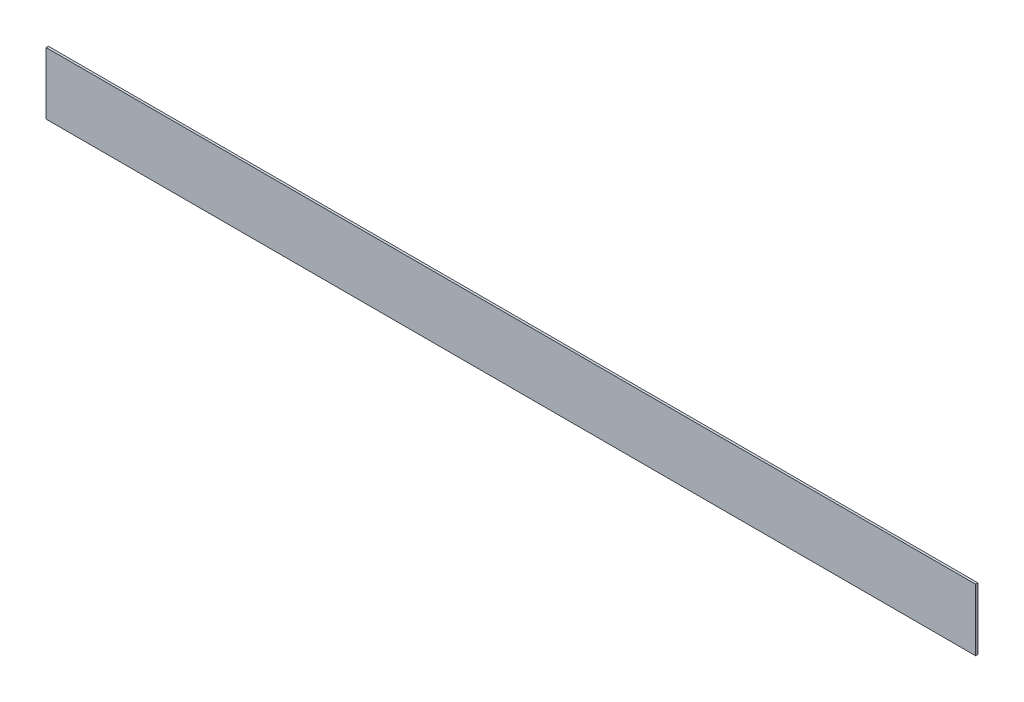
ISO-10303-21;
HEADER;
FILE_DESCRIPTION(('STEP AP214'),'2;1');
FILE_NAME('part.step','',(''),(''),'','','');
FILE_SCHEMA(('AUTOMOTIVE_DESIGN { 1 0 10303 214 1 1 1 1 }'));
ENDSEC;
DATA;
#1=APPLICATION_CONTEXT('core data for automotive mechanical design processes');
#2=APPLICATION_PROTOCOL_DEFINITION('international standard','automotive_design',2000,#1);
#3=PRODUCT_CONTEXT('',#1,'mechanical');
#4=PRODUCT('Part','Part','',(#3));
#5=PRODUCT_RELATED_PRODUCT_CATEGORY('part','',(#4));
#6=PRODUCT_DEFINITION_FORMATION('','',#4);
#7=PRODUCT_DEFINITION_CONTEXT('part definition',#1,'design');
#8=PRODUCT_DEFINITION('design','',#6,#7);
#9=PRODUCT_DEFINITION_SHAPE('','',#8);
#10=(LENGTH_UNIT() NAMED_UNIT(*) SI_UNIT(.MILLI.,.METRE.));
#11=(NAMED_UNIT(*) PLANE_ANGLE_UNIT() SI_UNIT($,.RADIAN.));
#12=(NAMED_UNIT(*) SI_UNIT($,.STERADIAN.) SOLID_ANGLE_UNIT());
#13=UNCERTAINTY_MEASURE_WITH_UNIT(LENGTH_MEASURE(1.E-05),#10,'distance_accuracy_value','');
#14=(GEOMETRIC_REPRESENTATION_CONTEXT(3) GLOBAL_UNCERTAINTY_ASSIGNED_CONTEXT((#13)) GLOBAL_UNIT_ASSIGNED_CONTEXT((#10,
#11,#12)) REPRESENTATION_CONTEXT('',''));
#15=CARTESIAN_POINT('',(0.,0.,0.));
#16=DIRECTION('',(0.,0.,1.));
#17=DIRECTION('',(1.,0.,0.));
#18=AXIS2_PLACEMENT_3D('',#15,#16,#17);
#19=CARTESIAN_POINT('',(0.,-203.2,0.));
#20=DIRECTION('',(-1.,0.,0.));
#21=DIRECTION('',(0.,0.,1.));
#22=AXIS2_PLACEMENT_3D('',#19,#20,#21);
#23=PLANE('',#22);
#24=DIRECTION('',(0.,0.,1.));
#25=VECTOR('',#24,1.);
#26=CARTESIAN_POINT('',(0.,0.,0.));
#27=LINE('',#26,#25);
#28=CARTESIAN_POINT('',(0.,0.,-7.62000000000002));
#29=VERTEX_POINT('',#28);
#30=CARTESIAN_POINT('',(0.,0.,0.));
#31=VERTEX_POINT('',#30);
#32=EDGE_CURVE('E115',#29,#31,#27,.T.);
#33=ORIENTED_EDGE('',*,*,#32,.F.);
#34=DIRECTION('',(0.,1.,0.));
#35=VECTOR('',#34,1.);
#36=CARTESIAN_POINT('',(0.,-203.2,-7.62000000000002));
#37=LINE('',#36,#35);
#38=CARTESIAN_POINT('',(0.,-203.2,-7.62000000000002));
#39=VERTEX_POINT('',#38);
#40=EDGE_CURVE('E11',#39,#29,#37,.T.);
#41=ORIENTED_EDGE('',*,*,#40,.F.);
#42=DIRECTION('',(0.,0.,1.));
#43=VECTOR('',#42,1.);
#44=CARTESIAN_POINT('',(0.,-203.2,0.));
#45=LINE('',#44,#43);
#46=CARTESIAN_POINT('',(0.,-203.2,0.));
#47=VERTEX_POINT('',#46);
#48=EDGE_CURVE('E107',#39,#47,#45,.T.);
#49=ORIENTED_EDGE('',*,*,#48,.T.);
#50=DIRECTION('',(0.,1.,0.));
#51=VECTOR('',#50,1.);
#52=CARTESIAN_POINT('',(0.,-203.2,0.));
#53=LINE('',#52,#51);
#54=EDGE_CURVE('E48',#47,#31,#53,.T.);
#55=ORIENTED_EDGE('',*,*,#54,.T.);
#56=EDGE_LOOP('',(#33,#41,#49,#55));
#57=FACE_BOUND('',#56,.T.);
#58=ADVANCED_FACE('F45',(#57),#23,.T.);
#59=CARTESIAN_POINT('',(0.,-203.2,-7.62000000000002));
#60=DIRECTION('',(0.,0.,-1.));
#61=DIRECTION('',(-1.,0.,0.));
#62=AXIS2_PLACEMENT_3D('',#59,#60,#61);
#63=PLANE('',#62);
#64=DIRECTION('',(-1.,0.,0.));
#65=VECTOR('',#64,1.);
#66=CARTESIAN_POINT('',(0.,0.,-7.62000000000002));
#67=LINE('',#66,#65);
#68=CARTESIAN_POINT('',(3048.,0.,-7.62));
#69=VERTEX_POINT('',#68);
#70=EDGE_CURVE('E110',#69,#29,#67,.T.);
#71=ORIENTED_EDGE('',*,*,#70,.F.);
#72=DIRECTION('',(0.,1.,0.));
#73=VECTOR('',#72,1.);
#74=CARTESIAN_POINT('',(3048.,-203.2,-7.62));
#75=LINE('',#74,#73);
#76=CARTESIAN_POINT('',(3048.,-203.2,-7.62));
#77=VERTEX_POINT('',#76);
#78=EDGE_CURVE('E55',#77,#69,#75,.T.);
#79=ORIENTED_EDGE('',*,*,#78,.F.);
#80=DIRECTION('',(-1.,0.,0.));
#81=VECTOR('',#80,1.);
#82=CARTESIAN_POINT('',(0.,-203.2,-7.62000000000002));
#83=LINE('',#82,#81);
#84=EDGE_CURVE('E102',#77,#39,#83,.T.);
#85=ORIENTED_EDGE('',*,*,#84,.T.);
#86=ORIENTED_EDGE('',*,*,#40,.T.);
#87=EDGE_LOOP('',(#71,#79,#85,#86));
#88=FACE_BOUND('',#87,.T.);
#89=ADVANCED_FACE('F131',(#88),#63,.T.);
#90=CARTESIAN_POINT('',(3048.,-203.2,0.));
#91=DIRECTION('',(1.,0.,0.));
#92=DIRECTION('',(0.,0.,-1.));
#93=AXIS2_PLACEMENT_3D('',#90,#91,#92);
#94=PLANE('',#93);
#95=DIRECTION('',(0.,0.,-1.));
#96=VECTOR('',#95,1.);
#97=CARTESIAN_POINT('',(3048.,0.,0.));
#98=LINE('',#97,#96);
#99=CARTESIAN_POINT('',(3048.,0.,0.));
#100=VERTEX_POINT('',#99);
#101=EDGE_CURVE('E96',#100,#69,#98,.T.);
#102=ORIENTED_EDGE('',*,*,#101,.F.);
#103=DIRECTION('',(0.,1.,0.));
#104=VECTOR('',#103,1.);
#105=CARTESIAN_POINT('',(3048.,-203.2,0.));
#106=LINE('',#105,#104);
#107=CARTESIAN_POINT('',(3048.,-203.2,0.));
#108=VERTEX_POINT('',#107);
#109=EDGE_CURVE('E91',#108,#100,#106,.T.);
#110=ORIENTED_EDGE('',*,*,#109,.F.);
#111=DIRECTION('',(0.,0.,-1.));
#112=VECTOR('',#111,1.);
#113=CARTESIAN_POINT('',(3048.,-203.2,0.));
#114=LINE('',#113,#112);
#115=EDGE_CURVE('E94',#108,#77,#114,.T.);
#116=ORIENTED_EDGE('',*,*,#115,.T.);
#117=ORIENTED_EDGE('',*,*,#78,.T.);
#118=EDGE_LOOP('',(#102,#110,#116,#117));
#119=FACE_BOUND('',#118,.T.);
#120=ADVANCED_FACE('F93',(#119),#94,.T.);
#121=CARTESIAN_POINT('',(0.,-203.2,0.));
#122=DIRECTION('',(0.,0.,1.));
#123=DIRECTION('',(1.,0.,0.));
#124=AXIS2_PLACEMENT_3D('',#121,#122,#123);
#125=PLANE('',#124);
#126=DIRECTION('',(1.,0.,0.));
#127=VECTOR('',#126,1.);
#128=CARTESIAN_POINT('',(0.,0.,0.));
#129=LINE('',#128,#127);
#130=EDGE_CURVE('E119',#31,#100,#129,.T.);
#131=ORIENTED_EDGE('',*,*,#130,.F.);
#132=ORIENTED_EDGE('',*,*,#54,.F.);
#133=DIRECTION('',(1.,0.,0.));
#134=VECTOR('',#133,1.);
#135=CARTESIAN_POINT('',(0.,-203.2,0.));
#136=LINE('',#135,#134);
#137=EDGE_CURVE('E101',#47,#108,#136,.T.);
#138=ORIENTED_EDGE('',*,*,#137,.T.);
#139=ORIENTED_EDGE('',*,*,#109,.T.);
#140=EDGE_LOOP('',(#131,#132,#138,#139));
#141=FACE_BOUND('',#140,.T.);
#142=ADVANCED_FACE('F105',(#141),#125,.T.);
#143=CARTESIAN_POINT('',(0.,-203.2,0.));
#144=DIRECTION('',(0.,-1.,0.));
#145=DIRECTION('',(0.,0.,-1.));
#146=AXIS2_PLACEMENT_3D('',#143,#144,#145);
#147=PLANE('',#146);
#148=ORIENTED_EDGE('',*,*,#48,.F.);
#149=ORIENTED_EDGE('',*,*,#84,.F.);
#150=ORIENTED_EDGE('',*,*,#115,.F.);
#151=ORIENTED_EDGE('',*,*,#137,.F.);
#152=EDGE_LOOP('',(#148,#149,#150,#151));
#153=FACE_BOUND('',#152,.T.);
#154=ADVANCED_FACE('F100',(#153),#147,.T.);
#155=CARTESIAN_POINT('',(0.,0.,0.));
#156=DIRECTION('',(0.,-1.,0.));
#157=DIRECTION('',(0.,0.,-1.));
#158=AXIS2_PLACEMENT_3D('',#155,#156,#157);
#159=PLANE('',#158);
#160=ORIENTED_EDGE('',*,*,#32,.T.);
#161=ORIENTED_EDGE('',*,*,#130,.T.);
#162=ORIENTED_EDGE('',*,*,#101,.T.);
#163=ORIENTED_EDGE('',*,*,#70,.T.);
#164=EDGE_LOOP('',(#160,#161,#162,#163));
#165=FACE_BOUND('',#164,.T.);
#166=ADVANCED_FACE('F130',(#165),#159,.F.);
#167=CLOSED_SHELL('',(#58,#89,#120,#142,#154,#166));
#168=MANIFOLD_SOLID_BREP('B2',#167);
#169=ADVANCED_BREP_SHAPE_REPRESENTATION('',(#18,#168),#14);
#170=SHAPE_DEFINITION_REPRESENTATION(#9,#169);
ENDSEC;
END-ISO-10303-21;
